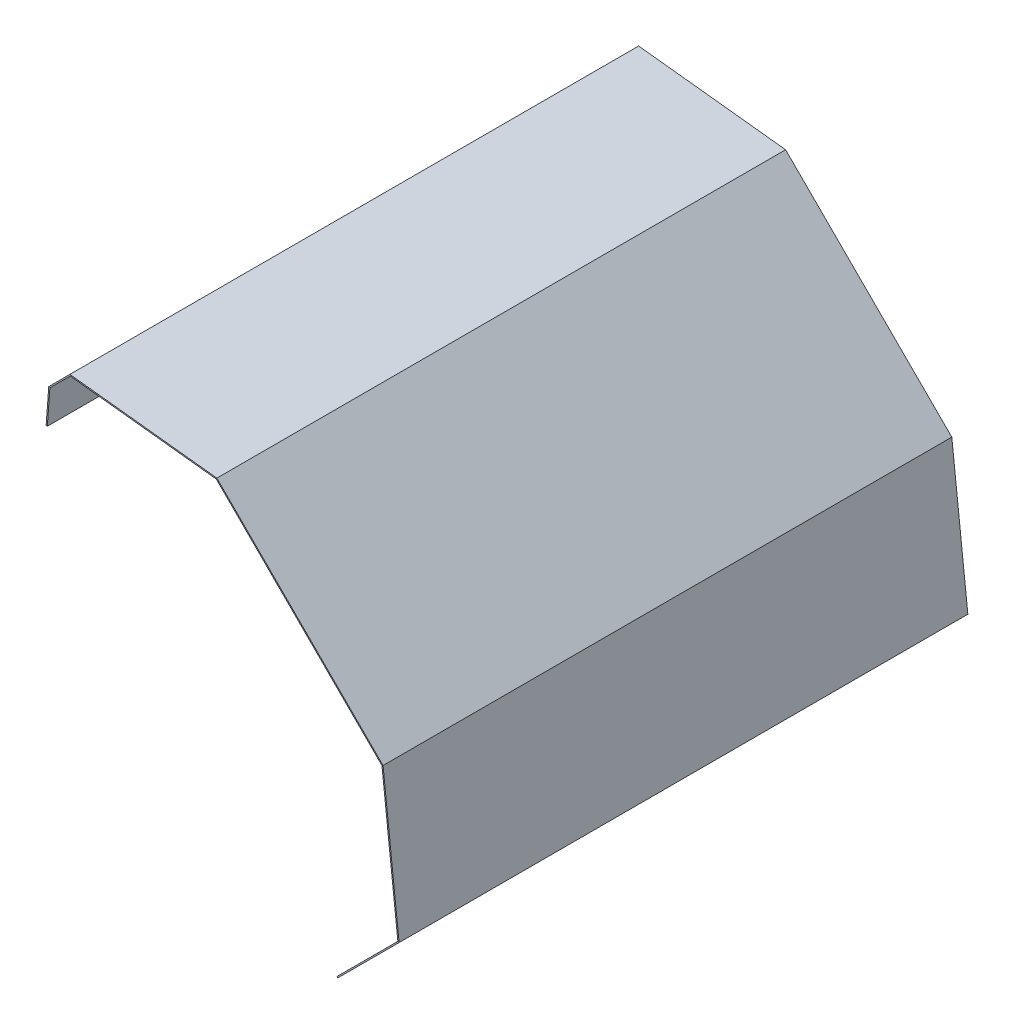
ISO-10303-21;
HEADER;
FILE_DESCRIPTION(('STEP AP214'),'2;1');
FILE_NAME('part.step','',(''),(''),'','','');
FILE_SCHEMA(('AUTOMOTIVE_DESIGN { 1 0 10303 214 1 1 1 1 }'));
ENDSEC;
DATA;
#1=APPLICATION_CONTEXT('core data for automotive mechanical design processes');
#2=APPLICATION_PROTOCOL_DEFINITION('international standard','automotive_design',2000,#1);
#3=PRODUCT_CONTEXT('',#1,'mechanical');
#4=PRODUCT('Part','Part','',(#3));
#5=PRODUCT_RELATED_PRODUCT_CATEGORY('part','',(#4));
#6=PRODUCT_DEFINITION_FORMATION('','',#4);
#7=PRODUCT_DEFINITION_CONTEXT('part definition',#1,'design');
#8=PRODUCT_DEFINITION('design','',#6,#7);
#9=PRODUCT_DEFINITION_SHAPE('','',#8);
#10=(LENGTH_UNIT() NAMED_UNIT(*) SI_UNIT(.MILLI.,.METRE.));
#11=(NAMED_UNIT(*) PLANE_ANGLE_UNIT() SI_UNIT($,.RADIAN.));
#12=(NAMED_UNIT(*) SI_UNIT($,.STERADIAN.) SOLID_ANGLE_UNIT());
#13=UNCERTAINTY_MEASURE_WITH_UNIT(LENGTH_MEASURE(1.E-05),#10,'distance_accuracy_value','');
#14=(GEOMETRIC_REPRESENTATION_CONTEXT(3) GLOBAL_UNCERTAINTY_ASSIGNED_CONTEXT((#13)) GLOBAL_UNIT_ASSIGNED_CONTEXT((#10,
#11,#12)) REPRESENTATION_CONTEXT('',''));
#15=CARTESIAN_POINT('',(0.,0.,0.));
#16=DIRECTION('',(0.,0.,1.));
#17=DIRECTION('',(1.,0.,0.));
#18=AXIS2_PLACEMENT_3D('',#15,#16,#17);
#19=CARTESIAN_POINT('',(149.894360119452,457.90893687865,238.));
#20=DIRECTION('',(0.997252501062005,-0.0740773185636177,0.));
#21=DIRECTION('',(0.0740773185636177,0.997252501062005,0.));
#22=AXIS2_PLACEMENT_3D('',#19,#20,#21);
#23=PLANE('',#22);
#24=DIRECTION('',(-0.0740773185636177,-0.997252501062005,0.));
#25=VECTOR('',#24,1.);
#26=CARTESIAN_POINT('',(149.894360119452,457.90893687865,0.));
#27=LINE('',#26,#25);
#28=CARTESIAN_POINT('',(149.908116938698,458.094135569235,0.));
#29=VERTEX_POINT('',#28);
#30=CARTESIAN_POINT('',(148.82012330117,443.447218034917,0.));
#31=VERTEX_POINT('',#30);
#32=EDGE_CURVE('E177',#29,#31,#27,.T.);
#33=ORIENTED_EDGE('',*,*,#32,.T.);
#34=DIRECTION('',(0.,0.,-1.));
#35=VECTOR('',#34,1.);
#36=CARTESIAN_POINT('',(148.82012330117,443.447218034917,238.));
#37=LINE('',#36,#35);
#38=CARTESIAN_POINT('',(148.82012330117,443.447218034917,238.));
#39=VERTEX_POINT('',#38);
#40=EDGE_CURVE('E11',#39,#31,#37,.T.);
#41=ORIENTED_EDGE('',*,*,#40,.F.);
#42=DIRECTION('',(-0.0740773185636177,-0.997252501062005,0.));
#43=VECTOR('',#42,1.);
#44=CARTESIAN_POINT('',(149.894360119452,457.90893687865,238.));
#45=LINE('',#44,#43);
#46=CARTESIAN_POINT('',(149.908116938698,458.094135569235,238.));
#47=VERTEX_POINT('',#46);
#48=EDGE_CURVE('E116',#47,#39,#45,.T.);
#49=ORIENTED_EDGE('',*,*,#48,.F.);
#50=DIRECTION('',(0.,0.,-1.));
#51=VECTOR('',#50,1.);
#52=CARTESIAN_POINT('',(149.908116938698,458.094135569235,238.));
#53=LINE('',#52,#51);
#54=EDGE_CURVE('E173',#47,#29,#53,.T.);
#55=ORIENTED_EDGE('',*,*,#54,.T.);
#56=EDGE_LOOP('',(#33,#41,#49,#55));
#57=FACE_BOUND('',#56,.T.);
#58=ADVANCED_FACE('F41',(#57),#23,.F.);
#59=CARTESIAN_POINT('',(149.318749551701,443.410179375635,238.));
#60=DIRECTION('',(-0.0740773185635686,-0.997252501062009,0.));
#61=DIRECTION('',(0.997252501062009,-0.0740773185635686,0.));
#62=AXIS2_PLACEMENT_3D('',#59,#60,#61);
#63=PLANE('',#62);
#64=DIRECTION('',(-0.997252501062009,0.0740773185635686,0.));
#65=VECTOR('',#64,1.);
#66=CARTESIAN_POINT('',(149.318749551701,443.410179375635,0.));
#67=LINE('',#66,#65);
#68=CARTESIAN_POINT('',(149.318749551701,443.410179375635,0.));
#69=VERTEX_POINT('',#68);
#70=EDGE_CURVE('E181',#69,#31,#67,.T.);
#71=ORIENTED_EDGE('',*,*,#70,.F.);
#72=DIRECTION('',(0.,0.,-1.));
#73=VECTOR('',#72,1.);
#74=CARTESIAN_POINT('',(149.318749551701,443.410179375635,238.));
#75=LINE('',#74,#73);
#76=CARTESIAN_POINT('',(149.318749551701,443.410179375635,238.));
#77=VERTEX_POINT('',#76);
#78=EDGE_CURVE('E50',#77,#69,#75,.T.);
#79=ORIENTED_EDGE('',*,*,#78,.F.);
#80=DIRECTION('',(-0.997252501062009,0.0740773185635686,0.));
#81=VECTOR('',#80,1.);
#82=CARTESIAN_POINT('',(149.318749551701,443.410179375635,238.));
#83=LINE('',#82,#81);
#84=EDGE_CURVE('E278',#77,#39,#83,.T.);
#85=ORIENTED_EDGE('',*,*,#84,.T.);
#86=ORIENTED_EDGE('',*,*,#40,.T.);
#87=EDGE_LOOP('',(#71,#79,#85,#86));
#88=FACE_BOUND('',#87,.T.);
#89=ADVANCED_FACE('F265',(#88),#63,.T.);
#90=CARTESIAN_POINT('',(150.392986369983,457.871898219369,238.));
#91=DIRECTION('',(0.997252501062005,-0.0740773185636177,0.));
#92=DIRECTION('',(0.0740773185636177,0.997252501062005,0.));
#93=AXIS2_PLACEMENT_3D('',#90,#91,#92);
#94=PLANE('',#93);
#95=DIRECTION('',(-0.0740773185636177,-0.997252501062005,0.));
#96=VECTOR('',#95,1.);
#97=CARTESIAN_POINT('',(150.392986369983,457.871898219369,0.));
#98=LINE('',#97,#96);
#99=CARTESIAN_POINT('',(150.392986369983,457.871898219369,0.));
#100=VERTEX_POINT('',#99);
#101=EDGE_CURVE('E185',#100,#69,#98,.T.);
#102=ORIENTED_EDGE('',*,*,#101,.F.);
#103=DIRECTION('',(0.,0.,-1.));
#104=VECTOR('',#103,1.);
#105=CARTESIAN_POINT('',(150.392986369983,457.871898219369,238.));
#106=LINE('',#105,#104);
#107=CARTESIAN_POINT('',(150.392986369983,457.871898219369,238.));
#108=VERTEX_POINT('',#107);
#109=EDGE_CURVE('E253',#108,#100,#106,.T.);
#110=ORIENTED_EDGE('',*,*,#109,.F.);
#111=DIRECTION('',(-0.0740773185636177,-0.997252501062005,0.));
#112=VECTOR('',#111,1.);
#113=CARTESIAN_POINT('',(150.392986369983,457.871898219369,238.));
#114=LINE('',#113,#112);
#115=EDGE_CURVE('E262',#108,#77,#114,.T.);
#116=ORIENTED_EDGE('',*,*,#115,.T.);
#117=ORIENTED_EDGE('',*,*,#78,.T.);
#118=EDGE_LOOP('',(#102,#110,#116,#117));
#119=FACE_BOUND('',#118,.T.);
#120=ADVANCED_FACE('F260',(#119),#94,.T.);
#121=CARTESIAN_POINT('',(158.938048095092,466.416959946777,238.));
#122=DIRECTION('',(0.707106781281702,-0.707106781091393,0.));
#123=DIRECTION('',(0.707106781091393,0.707106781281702,0.));
#124=AXIS2_PLACEMENT_3D('',#121,#122,#123);
#125=PLANE('',#124);
#126=DIRECTION('',(-0.707106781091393,-0.707106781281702,0.));
#127=VECTOR('',#126,1.);
#128=CARTESIAN_POINT('',(158.938048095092,466.416959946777,0.));
#129=LINE('',#128,#127);
#130=CARTESIAN_POINT('',(158.938048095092,466.416959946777,0.));
#131=VERTEX_POINT('',#130);
#132=EDGE_CURVE('E189',#131,#100,#129,.T.);
#133=ORIENTED_EDGE('',*,*,#132,.F.);
#134=DIRECTION('',(0.,0.,-1.));
#135=VECTOR('',#134,1.);
#136=CARTESIAN_POINT('',(158.938048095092,466.416959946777,238.));
#137=LINE('',#136,#135);
#138=CARTESIAN_POINT('',(158.938048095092,466.416959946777,238.));
#139=VERTEX_POINT('',#138);
#140=EDGE_CURVE('E250',#139,#131,#137,.T.);
#141=ORIENTED_EDGE('',*,*,#140,.F.);
#142=DIRECTION('',(-0.707106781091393,-0.707106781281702,0.));
#143=VECTOR('',#142,1.);
#144=CARTESIAN_POINT('',(158.938048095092,466.416959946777,238.));
#145=LINE('',#144,#143);
#146=EDGE_CURVE('E275',#139,#108,#145,.T.);
#147=ORIENTED_EDGE('',*,*,#146,.T.);
#148=ORIENTED_EDGE('',*,*,#109,.T.);
#149=EDGE_LOOP('',(#133,#141,#147,#148));
#150=FACE_BOUND('',#149,.T.);
#151=ADVANCED_FACE('F272',(#150),#125,.T.);
#152=CARTESIAN_POINT('',(220.033932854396,459.616188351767,238.));
#153=DIRECTION('',(-0.11062981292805,-0.993861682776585,0.));
#154=DIRECTION('',(0.993861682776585,-0.11062981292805,0.));
#155=AXIS2_PLACEMENT_3D('',#152,#153,#154);
#156=PLANE('',#155);
#157=DIRECTION('',(-0.993861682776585,0.11062981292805,0.));
#158=VECTOR('',#157,1.);
#159=CARTESIAN_POINT('',(220.033932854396,459.616188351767,0.));
#160=LINE('',#159,#158);
#161=CARTESIAN_POINT('',(220.033932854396,459.616188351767,0.));
#162=VERTEX_POINT('',#161);
#163=EDGE_CURVE('E193',#162,#131,#160,.T.);
#164=ORIENTED_EDGE('',*,*,#163,.F.);
#165=DIRECTION('',(0.,0.,-1.));
#166=VECTOR('',#165,1.);
#167=CARTESIAN_POINT('',(220.033932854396,459.616188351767,238.));
#168=LINE('',#167,#166);
#169=CARTESIAN_POINT('',(220.033932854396,459.616188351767,238.));
#170=VERTEX_POINT('',#169);
#171=EDGE_CURVE('E247',#170,#162,#168,.T.);
#172=ORIENTED_EDGE('',*,*,#171,.F.);
#173=DIRECTION('',(-0.993861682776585,0.11062981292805,0.));
#174=VECTOR('',#173,1.);
#175=CARTESIAN_POINT('',(220.033932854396,459.616188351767,238.));
#176=LINE('',#175,#174);
#177=EDGE_CURVE('E283',#170,#139,#176,.T.);
#178=ORIENTED_EDGE('',*,*,#177,.T.);
#179=ORIENTED_EDGE('',*,*,#140,.T.);
#180=EDGE_LOOP('',(#164,#172,#178,#179));
#181=FACE_BOUND('',#180,.T.);
#182=ADVANCED_FACE('F341',(#181),#156,.T.);
#183=CARTESIAN_POINT('',(289.33516741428,390.49787562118,238.));
#184=DIRECTION('',(-0.706171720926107,-0.708040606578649,0.));
#185=DIRECTION('',(0.708040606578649,-0.706171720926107,0.));
#186=AXIS2_PLACEMENT_3D('',#183,#184,#185);
#187=PLANE('',#186);
#188=DIRECTION('',(-0.708040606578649,0.706171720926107,0.));
#189=VECTOR('',#188,1.);
#190=CARTESIAN_POINT('',(289.33516741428,390.49787562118,0.));
#191=LINE('',#190,#189);
#192=CARTESIAN_POINT('',(289.33516741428,390.49787562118,0.));
#193=VERTEX_POINT('',#192);
#194=EDGE_CURVE('E197',#193,#162,#191,.T.);
#195=ORIENTED_EDGE('',*,*,#194,.F.);
#196=DIRECTION('',(0.,0.,-1.));
#197=VECTOR('',#196,1.);
#198=CARTESIAN_POINT('',(289.33516741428,390.49787562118,238.));
#199=LINE('',#198,#197);
#200=CARTESIAN_POINT('',(289.33516741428,390.49787562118,238.));
#201=VERTEX_POINT('',#200);
#202=EDGE_CURVE('E244',#201,#193,#199,.T.);
#203=ORIENTED_EDGE('',*,*,#202,.F.);
#204=DIRECTION('',(-0.708040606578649,0.706171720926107,0.));
#205=VECTOR('',#204,1.);
#206=CARTESIAN_POINT('',(289.33516741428,390.49787562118,238.));
#207=LINE('',#206,#205);
#208=EDGE_CURVE('E290',#201,#170,#207,.T.);
#209=ORIENTED_EDGE('',*,*,#208,.T.);
#210=ORIENTED_EDGE('',*,*,#171,.T.);
#211=EDGE_LOOP('',(#195,#203,#209,#210));
#212=FACE_BOUND('',#211,.T.);
#213=ADVANCED_FACE('F344',(#212),#187,.T.);
#214=CARTESIAN_POINT('',(296.011813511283,330.087947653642,238.));
#215=DIRECTION('',(-0.993947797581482,-0.109853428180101,0.));
#216=DIRECTION('',(0.109853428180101,-0.993947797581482,0.));
#217=AXIS2_PLACEMENT_3D('',#214,#215,#216);
#218=PLANE('',#217);
#219=DIRECTION('',(-0.109853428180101,0.993947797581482,0.));
#220=VECTOR('',#219,1.);
#221=CARTESIAN_POINT('',(296.011813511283,330.087947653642,0.));
#222=LINE('',#221,#220);
#223=CARTESIAN_POINT('',(296.011813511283,330.087947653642,0.));
#224=VERTEX_POINT('',#223);
#225=EDGE_CURVE('E201',#224,#193,#222,.T.);
#226=ORIENTED_EDGE('',*,*,#225,.F.);
#227=DIRECTION('',(0.,0.,-1.));
#228=VECTOR('',#227,1.);
#229=CARTESIAN_POINT('',(296.011813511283,330.087947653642,238.));
#230=LINE('',#229,#228);
#231=CARTESIAN_POINT('',(296.011813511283,330.087947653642,238.));
#232=VERTEX_POINT('',#231);
#233=EDGE_CURVE('E241',#232,#224,#230,.T.);
#234=ORIENTED_EDGE('',*,*,#233,.F.);
#235=DIRECTION('',(-0.109853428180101,0.993947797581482,0.));
#236=VECTOR('',#235,1.);
#237=CARTESIAN_POINT('',(296.011813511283,330.087947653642,238.));
#238=LINE('',#237,#236);
#239=EDGE_CURVE('E294',#232,#201,#238,.T.);
#240=ORIENTED_EDGE('',*,*,#239,.T.);
#241=ORIENTED_EDGE('',*,*,#202,.T.);
#242=EDGE_LOOP('',(#226,#234,#240,#241));
#243=FACE_BOUND('',#242,.T.);
#244=ADVANCED_FACE('F348',(#243),#218,.T.);
#245=CARTESIAN_POINT('',(270.477763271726,304.573496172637,238.));
#246=DIRECTION('',(-0.706835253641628,0.707378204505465,0.));
#247=DIRECTION('',(-0.707378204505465,-0.706835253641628,0.));
#248=AXIS2_PLACEMENT_3D('',#245,#246,#247);
#249=PLANE('',#248);
#250=DIRECTION('',(0.707378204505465,0.706835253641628,0.));
#251=VECTOR('',#250,1.);
#252=CARTESIAN_POINT('',(270.477763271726,304.573496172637,0.));
#253=LINE('',#252,#251);
#254=CARTESIAN_POINT('',(270.477763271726,304.573496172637,0.));
#255=VERTEX_POINT('',#254);
#256=EDGE_CURVE('E205',#255,#224,#253,.T.);
#257=ORIENTED_EDGE('',*,*,#256,.F.);
#258=DIRECTION('',(0.,0.,-1.));
#259=VECTOR('',#258,1.);
#260=CARTESIAN_POINT('',(270.477763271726,304.573496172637,238.));
#261=LINE('',#260,#259);
#262=CARTESIAN_POINT('',(270.477763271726,304.573496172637,238.));
#263=VERTEX_POINT('',#262);
#264=EDGE_CURVE('E238',#263,#255,#261,.T.);
#265=ORIENTED_EDGE('',*,*,#264,.F.);
#266=DIRECTION('',(0.707378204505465,0.706835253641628,0.));
#267=VECTOR('',#266,1.);
#268=CARTESIAN_POINT('',(270.477763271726,304.573496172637,238.));
#269=LINE('',#268,#267);
#270=EDGE_CURVE('E298',#263,#232,#269,.T.);
#271=ORIENTED_EDGE('',*,*,#270,.T.);
#272=ORIENTED_EDGE('',*,*,#233,.T.);
#273=EDGE_LOOP('',(#257,#265,#271,#272));
#274=FACE_BOUND('',#273,.T.);
#275=ADVANCED_FACE('F352',(#274),#249,.T.);
#276=CARTESIAN_POINT('',(270.831180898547,304.219807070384,238.));
#277=DIRECTION('',(-0.707378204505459,-0.706835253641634,0.));
#278=DIRECTION('',(0.706835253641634,-0.707378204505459,0.));
#279=AXIS2_PLACEMENT_3D('',#276,#277,#278);
#280=PLANE('',#279);
#281=DIRECTION('',(-0.706835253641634,0.707378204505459,0.));
#282=VECTOR('',#281,1.);
#283=CARTESIAN_POINT('',(270.831180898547,304.219807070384,0.));
#284=LINE('',#283,#282);
#285=CARTESIAN_POINT('',(270.831180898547,304.219807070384,0.));
#286=VERTEX_POINT('',#285);
#287=EDGE_CURVE('E209',#286,#255,#284,.T.);
#288=ORIENTED_EDGE('',*,*,#287,.F.);
#289=DIRECTION('',(0.,0.,-1.));
#290=VECTOR('',#289,1.);
#291=CARTESIAN_POINT('',(270.831180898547,304.219807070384,238.));
#292=LINE('',#291,#290);
#293=CARTESIAN_POINT('',(270.831180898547,304.219807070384,238.));
#294=VERTEX_POINT('',#293);
#295=EDGE_CURVE('E235',#294,#286,#292,.T.);
#296=ORIENTED_EDGE('',*,*,#295,.F.);
#297=DIRECTION('',(-0.706835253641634,0.707378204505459,0.));
#298=VECTOR('',#297,1.);
#299=CARTESIAN_POINT('',(270.831180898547,304.219807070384,238.));
#300=LINE('',#299,#298);
#301=EDGE_CURVE('E302',#294,#263,#300,.T.);
#302=ORIENTED_EDGE('',*,*,#301,.T.);
#303=ORIENTED_EDGE('',*,*,#264,.T.);
#304=EDGE_LOOP('',(#288,#296,#302,#303));
#305=FACE_BOUND('',#304,.T.);
#306=ADVANCED_FACE('F356',(#305),#280,.T.);
#307=CARTESIAN_POINT('',(270.831180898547,304.219807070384,238.));
#308=DIRECTION('',(-0.706835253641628,0.707378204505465,0.));
#309=DIRECTION('',(-0.707378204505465,-0.706835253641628,0.));
#310=AXIS2_PLACEMENT_3D('',#307,#308,#309);
#311=PLANE('',#310);
#312=DIRECTION('',(0.707378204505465,0.706835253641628,0.));
#313=VECTOR('',#312,1.);
#314=CARTESIAN_POINT('',(270.831180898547,304.219807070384,0.));
#315=LINE('',#314,#313);
#316=CARTESIAN_POINT('',(296.53517986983,329.904076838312,0.));
#317=VERTEX_POINT('',#316);
#318=EDGE_CURVE('E213',#286,#317,#315,.T.);
#319=ORIENTED_EDGE('',*,*,#318,.T.);
#320=DIRECTION('',(0.,0.,-1.));
#321=VECTOR('',#320,1.);
#322=CARTESIAN_POINT('',(296.53517986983,329.904076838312,238.));
#323=LINE('',#322,#321);
#324=CARTESIAN_POINT('',(296.53517986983,329.904076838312,238.));
#325=VERTEX_POINT('',#324);
#326=EDGE_CURVE('E231',#325,#317,#323,.T.);
#327=ORIENTED_EDGE('',*,*,#326,.F.);
#328=DIRECTION('',(0.707378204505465,0.706835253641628,0.));
#329=VECTOR('',#328,1.);
#330=CARTESIAN_POINT('',(270.831180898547,304.219807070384,238.));
#331=LINE('',#330,#329);
#332=EDGE_CURVE('E306',#294,#325,#331,.T.);
#333=ORIENTED_EDGE('',*,*,#332,.F.);
#334=ORIENTED_EDGE('',*,*,#295,.T.);
#335=EDGE_LOOP('',(#319,#327,#333,#334));
#336=FACE_BOUND('',#335,.T.);
#337=ADVANCED_FACE('F314',(#336),#311,.F.);
#338=CARTESIAN_POINT('',(296.508787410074,330.142874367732,238.));
#339=DIRECTION('',(-0.993947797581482,-0.109853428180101,0.));
#340=DIRECTION('',(0.109853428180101,-0.993947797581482,0.));
#341=AXIS2_PLACEMENT_3D('',#338,#339,#340);
#342=PLANE('',#341);
#343=DIRECTION('',(-0.109853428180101,0.993947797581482,0.));
#344=VECTOR('',#343,1.);
#345=CARTESIAN_POINT('',(296.508787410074,330.142874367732,0.));
#346=LINE('',#345,#344);
#347=CARTESIAN_POINT('',(289.812815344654,390.727662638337,0.));
#348=VERTEX_POINT('',#347);
#349=EDGE_CURVE('E216',#317,#348,#346,.T.);
#350=ORIENTED_EDGE('',*,*,#349,.T.);
#351=DIRECTION('',(0.,0.,-1.));
#352=VECTOR('',#351,1.);
#353=CARTESIAN_POINT('',(289.812815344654,390.727662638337,238.));
#354=LINE('',#353,#352);
#355=CARTESIAN_POINT('',(289.812815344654,390.727662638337,238.));
#356=VERTEX_POINT('',#355);
#357=EDGE_CURVE('E166',#356,#348,#354,.T.);
#358=ORIENTED_EDGE('',*,*,#357,.F.);
#359=DIRECTION('',(-0.109853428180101,0.993947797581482,0.));
#360=VECTOR('',#359,1.);
#361=CARTESIAN_POINT('',(296.508787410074,330.142874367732,238.));
#362=LINE('',#361,#360);
#363=EDGE_CURVE('E155',#325,#356,#362,.T.);
#364=ORIENTED_EDGE('',*,*,#363,.F.);
#365=ORIENTED_EDGE('',*,*,#326,.T.);
#366=EDGE_LOOP('',(#350,#358,#364,#365));
#367=FACE_BOUND('',#366,.T.);
#368=ADVANCED_FACE('F318',(#367),#342,.F.);
#369=CARTESIAN_POINT('',(289.688253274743,390.851895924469,238.));
#370=DIRECTION('',(-0.706171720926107,-0.708040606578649,0.));
#371=DIRECTION('',(0.708040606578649,-0.706171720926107,0.));
#372=AXIS2_PLACEMENT_3D('',#369,#370,#371);
#373=PLANE('',#372);
#374=DIRECTION('',(-0.708040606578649,0.706171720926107,0.));
#375=VECTOR('',#374,1.);
#376=CARTESIAN_POINT('',(289.688253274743,390.851895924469,0.));
#377=LINE('',#376,#375);
#378=CARTESIAN_POINT('',(220.263137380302,460.093763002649,0.));
#379=VERTEX_POINT('',#378);
#380=EDGE_CURVE('E164',#348,#379,#377,.T.);
#381=ORIENTED_EDGE('',*,*,#380,.T.);
#382=DIRECTION('',(0.,0.,-1.));
#383=VECTOR('',#382,1.);
#384=CARTESIAN_POINT('',(220.263137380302,460.093763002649,238.));
#385=LINE('',#384,#383);
#386=CARTESIAN_POINT('',(220.263137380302,460.093763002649,238.));
#387=VERTEX_POINT('',#386);
#388=EDGE_CURVE('E161',#387,#379,#385,.T.);
#389=ORIENTED_EDGE('',*,*,#388,.F.);
#390=DIRECTION('',(-0.708040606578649,0.706171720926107,0.));
#391=VECTOR('',#390,1.);
#392=CARTESIAN_POINT('',(289.688253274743,390.851895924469,238.));
#393=LINE('',#392,#391);
#394=EDGE_CURVE('E149',#356,#387,#393,.T.);
#395=ORIENTED_EDGE('',*,*,#394,.F.);
#396=ORIENTED_EDGE('',*,*,#357,.T.);
#397=EDGE_LOOP('',(#381,#389,#395,#396));
#398=FACE_BOUND('',#397,.T.);
#399=ADVANCED_FACE('F162',(#398),#373,.F.);
#400=CARTESIAN_POINT('',(220.08924776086,460.113119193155,238.));
#401=DIRECTION('',(-0.11062981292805,-0.993861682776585,0.));
#402=DIRECTION('',(0.993861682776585,-0.11062981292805,0.));
#403=AXIS2_PLACEMENT_3D('',#400,#401,#402);
#404=PLANE('',#403);
#405=DIRECTION('',(-0.993861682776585,0.11062981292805,0.));
#406=VECTOR('',#405,1.);
#407=CARTESIAN_POINT('',(220.08924776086,460.113119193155,0.));
#408=LINE('',#407,#406);
#409=CARTESIAN_POINT('',(158.754464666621,466.940483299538,0.));
#410=VERTEX_POINT('',#409);
#411=EDGE_CURVE('E104',#379,#410,#408,.T.);
#412=ORIENTED_EDGE('',*,*,#411,.T.);
#413=DIRECTION('',(0.,0.,-1.));
#414=VECTOR('',#413,1.);
#415=CARTESIAN_POINT('',(158.754464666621,466.940483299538,238.));
#416=LINE('',#415,#414);
#417=CARTESIAN_POINT('',(158.754464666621,466.940483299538,238.));
#418=VERTEX_POINT('',#417);
#419=EDGE_CURVE('E167',#418,#410,#416,.T.);
#420=ORIENTED_EDGE('',*,*,#419,.F.);
#421=DIRECTION('',(-0.993861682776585,0.11062981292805,0.));
#422=VECTOR('',#421,1.);
#423=CARTESIAN_POINT('',(220.08924776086,460.113119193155,238.));
#424=LINE('',#423,#422);
#425=EDGE_CURVE('E153',#387,#418,#424,.T.);
#426=ORIENTED_EDGE('',*,*,#425,.F.);
#427=ORIENTED_EDGE('',*,*,#388,.T.);
#428=EDGE_LOOP('',(#412,#420,#426,#427));
#429=FACE_BOUND('',#428,.T.);
#430=ADVANCED_FACE('F169',(#429),#404,.F.);
#431=CARTESIAN_POINT('',(158.584494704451,466.770513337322,238.));
#432=DIRECTION('',(0.707106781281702,-0.707106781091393,0.));
#433=DIRECTION('',(0.707106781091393,0.707106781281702,0.));
#434=AXIS2_PLACEMENT_3D('',#431,#432,#433);
#435=PLANE('',#434);
#436=DIRECTION('',(-0.707106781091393,-0.707106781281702,0.));
#437=VECTOR('',#436,1.);
#438=CARTESIAN_POINT('',(158.584494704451,466.770513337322,0.));
#439=LINE('',#438,#437);
#440=EDGE_CURVE('E110',#410,#29,#439,.T.);
#441=ORIENTED_EDGE('',*,*,#440,.T.);
#442=ORIENTED_EDGE('',*,*,#54,.F.);
#443=DIRECTION('',(-0.707106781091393,-0.707106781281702,0.));
#444=VECTOR('',#443,1.);
#445=CARTESIAN_POINT('',(158.584494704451,466.770513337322,238.));
#446=LINE('',#445,#444);
#447=EDGE_CURVE('E58',#418,#47,#446,.T.);
#448=ORIENTED_EDGE('',*,*,#447,.F.);
#449=ORIENTED_EDGE('',*,*,#419,.T.);
#450=EDGE_LOOP('',(#441,#442,#448,#449));
#451=FACE_BOUND('',#450,.T.);
#452=ADVANCED_FACE('F320',(#451),#435,.F.);
#453=CARTESIAN_POINT('',(0.,0.,238.));
#454=DIRECTION('',(0.,0.,-1.));
#455=DIRECTION('',(-1.,0.,0.));
#456=AXIS2_PLACEMENT_3D('',#453,#454,#455);
#457=PLANE('',#456);
#458=ORIENTED_EDGE('',*,*,#48,.T.);
#459=ORIENTED_EDGE('',*,*,#84,.F.);
#460=ORIENTED_EDGE('',*,*,#115,.F.);
#461=ORIENTED_EDGE('',*,*,#146,.F.);
#462=ORIENTED_EDGE('',*,*,#177,.F.);
#463=ORIENTED_EDGE('',*,*,#208,.F.);
#464=ORIENTED_EDGE('',*,*,#239,.F.);
#465=ORIENTED_EDGE('',*,*,#270,.F.);
#466=ORIENTED_EDGE('',*,*,#301,.F.);
#467=ORIENTED_EDGE('',*,*,#332,.T.);
#468=ORIENTED_EDGE('',*,*,#363,.T.);
#469=ORIENTED_EDGE('',*,*,#394,.T.);
#470=ORIENTED_EDGE('',*,*,#425,.T.);
#471=ORIENTED_EDGE('',*,*,#447,.T.);
#472=EDGE_LOOP('',(#458,#459,#460,#461,#462,#463,#464,#465,#466,#467,#468,#469,#470,#471));
#473=FACE_BOUND('',#472,.T.);
#474=ADVANCED_FACE('F151',(#473),#457,.F.);
#475=CARTESIAN_POINT('',(0.,0.,0.));
#476=DIRECTION('',(0.,0.,-1.));
#477=DIRECTION('',(-1.,0.,0.));
#478=AXIS2_PLACEMENT_3D('',#475,#476,#477);
#479=PLANE('',#478);
#480=ORIENTED_EDGE('',*,*,#32,.F.);
#481=ORIENTED_EDGE('',*,*,#440,.F.);
#482=ORIENTED_EDGE('',*,*,#411,.F.);
#483=ORIENTED_EDGE('',*,*,#380,.F.);
#484=ORIENTED_EDGE('',*,*,#349,.F.);
#485=ORIENTED_EDGE('',*,*,#318,.F.);
#486=ORIENTED_EDGE('',*,*,#287,.T.);
#487=ORIENTED_EDGE('',*,*,#256,.T.);
#488=ORIENTED_EDGE('',*,*,#225,.T.);
#489=ORIENTED_EDGE('',*,*,#194,.T.);
#490=ORIENTED_EDGE('',*,*,#163,.T.);
#491=ORIENTED_EDGE('',*,*,#132,.T.);
#492=ORIENTED_EDGE('',*,*,#101,.T.);
#493=ORIENTED_EDGE('',*,*,#70,.T.);
#494=EDGE_LOOP('',(#480,#481,#482,#483,#484,#485,#486,#487,#488,#489,#490,#491,#492,#493));
#495=FACE_BOUND('',#494,.T.);
#496=ADVANCED_FACE('F268',(#495),#479,.T.);
#497=CLOSED_SHELL('',(#58,#89,#120,#151,#182,#213,#244,#275,#306,#337,#368,#399,#430,#452,#474,#496));
#498=MANIFOLD_SOLID_BREP('B2',#497);
#499=ADVANCED_BREP_SHAPE_REPRESENTATION('',(#18,#498),#14);
#500=SHAPE_DEFINITION_REPRESENTATION(#9,#499);
ENDSEC;
END-ISO-10303-21;
